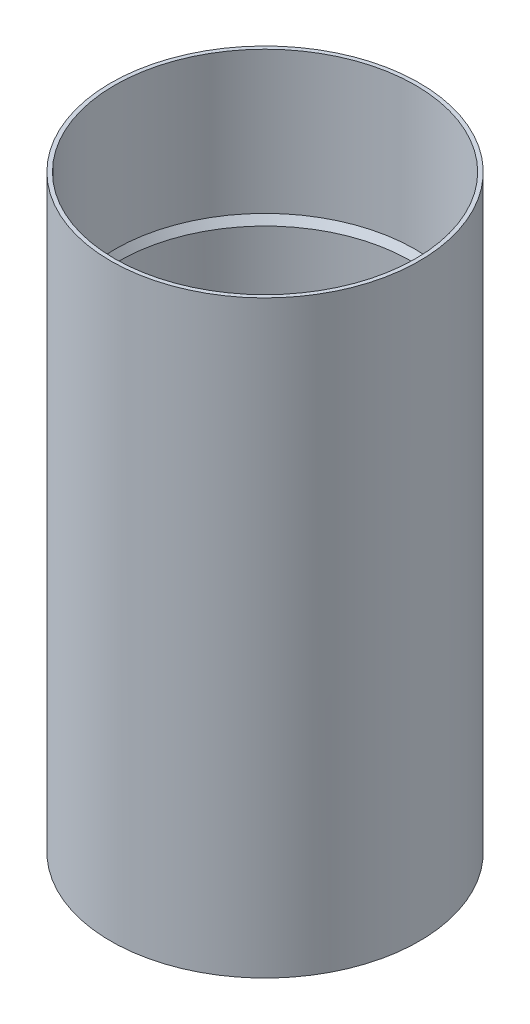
ISO-10303-21;
HEADER;
FILE_DESCRIPTION(('STEP AP214'),'2;1');
FILE_NAME('part.step','',(''),(''),'','','');
FILE_SCHEMA(('AUTOMOTIVE_DESIGN { 1 0 10303 214 1 1 1 1 }'));
ENDSEC;
DATA;
#1=APPLICATION_CONTEXT('core data for automotive mechanical design processes');
#2=APPLICATION_PROTOCOL_DEFINITION('international standard','automotive_design',2000,#1);
#3=PRODUCT_CONTEXT('',#1,'mechanical');
#4=PRODUCT('Part','Part','',(#3));
#5=PRODUCT_RELATED_PRODUCT_CATEGORY('part','',(#4));
#6=PRODUCT_DEFINITION_FORMATION('','',#4);
#7=PRODUCT_DEFINITION_CONTEXT('part definition',#1,'design');
#8=PRODUCT_DEFINITION('design','',#6,#7);
#9=PRODUCT_DEFINITION_SHAPE('','',#8);
#10=(LENGTH_UNIT() NAMED_UNIT(*) SI_UNIT(.MILLI.,.METRE.));
#11=(NAMED_UNIT(*) PLANE_ANGLE_UNIT() SI_UNIT($,.RADIAN.));
#12=(NAMED_UNIT(*) SI_UNIT($,.STERADIAN.) SOLID_ANGLE_UNIT());
#13=UNCERTAINTY_MEASURE_WITH_UNIT(LENGTH_MEASURE(1.E-05),#10,'distance_accuracy_value','');
#14=(GEOMETRIC_REPRESENTATION_CONTEXT(3) GLOBAL_UNCERTAINTY_ASSIGNED_CONTEXT((#13)) GLOBAL_UNIT_ASSIGNED_CONTEXT((#10,
#11,#12)) REPRESENTATION_CONTEXT('',''));
#15=CARTESIAN_POINT('',(0.,0.,0.));
#16=DIRECTION('',(0.,0.,1.));
#17=DIRECTION('',(1.,0.,0.));
#18=AXIS2_PLACEMENT_3D('',#15,#16,#17);
#19=CARTESIAN_POINT('',(0.,105.,0.));
#20=DIRECTION('',(0.,-1.,0.));
#21=DIRECTION('',(0.,0.,-1.));
#22=AXIS2_PLACEMENT_3D('',#19,#20,#21);
#23=CYLINDRICAL_SURFACE('',#22,26.);
#24=CARTESIAN_POINT('',(0.,78.2679491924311,0.));
#25=DIRECTION('',(0.,1.,0.));
#26=DIRECTION('',(0.,0.,1.));
#27=AXIS2_PLACEMENT_3D('',#24,#25,#26);
#28=CIRCLE('',#27,26.);
#29=CARTESIAN_POINT('',(0.,78.2679491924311,26.));
#30=VERTEX_POINT('',#29);
#31=EDGE_CURVE('E42',#30,#30,#28,.T.);
#32=ORIENTED_EDGE('',*,*,#31,.T.);
#33=EDGE_LOOP('',(#32));
#34=FACE_BOUND('',#33,.T.);
#35=CARTESIAN_POINT('',(0.,0.,0.));
#36=DIRECTION('',(0.,1.,0.));
#37=DIRECTION('',(0.,0.,1.));
#38=AXIS2_PLACEMENT_3D('',#35,#36,#37);
#39=CIRCLE('',#38,26.);
#40=CARTESIAN_POINT('',(-8.5,0.,-24.5713247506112));
#41=VERTEX_POINT('',#40);
#42=CARTESIAN_POINT('',(8.5,0.,-24.5713247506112));
#43=VERTEX_POINT('',#42);
#44=EDGE_CURVE('E249',#41,#43,#39,.T.);
#45=ORIENTED_EDGE('',*,*,#44,.F.);
#46=CARTESIAN_POINT('',(-8.5,0.,-24.5713247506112));
#47=CARTESIAN_POINT('',(-8.44182870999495,-3.91145126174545E-05,-24.5914570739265));
#48=CARTESIAN_POINT('',(-8.38356460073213,0.00507484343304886,-24.6113723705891));
#49=CARTESIAN_POINT('',(-8.26844314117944,0.0254324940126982,-24.6502824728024));
#50=CARTESIAN_POINT('',(-8.21158749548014,0.0406878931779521,-24.6692761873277));
#51=CARTESIAN_POINT('',(-8.10094424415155,0.0811780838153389,-24.7058319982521));
#52=CARTESIAN_POINT('',(-8.04716080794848,0.106426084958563,-24.7233921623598));
#53=CARTESIAN_POINT('',(-7.94451263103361,0.166357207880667,-24.7565672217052));
#54=CARTESIAN_POINT('',(-7.89564399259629,0.20103277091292,-24.772183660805));
#55=CARTESIAN_POINT('',(-7.8059967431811,0.277695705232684,-24.8005757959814));
#56=CARTESIAN_POINT('',(-7.76500488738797,0.319405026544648,-24.8134280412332));
#57=CARTESIAN_POINT('',(-7.69063870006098,0.409782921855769,-24.8365778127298));
#58=CARTESIAN_POINT('',(-7.65726506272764,0.458452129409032,-24.8468751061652));
#59=CARTESIAN_POINT('',(-7.60082495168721,0.558818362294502,-24.8641970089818));
#60=CARTESIAN_POINT('',(-7.57734071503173,0.610258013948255,-24.8713549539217));
#61=CARTESIAN_POINT('',(-7.53933933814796,0.716610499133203,-24.8829009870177));
#62=CARTESIAN_POINT('',(-7.52481093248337,0.77151887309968,-24.8872925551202));
#63=CARTESIAN_POINT('',(-7.51002940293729,0.855780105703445,-24.8917553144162));
#64=CARTESIAN_POINT('',(-7.50626972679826,0.884505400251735,-24.892889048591));
#65=CARTESIAN_POINT('',(-7.5012566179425,0.942148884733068,-24.8944000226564));
#66=CARTESIAN_POINT('',(-7.49999932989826,0.971066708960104,-24.8947784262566));
#67=CARTESIAN_POINT('',(-7.5,1.,-24.8947785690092));
#68=B_SPLINE_CURVE_WITH_KNOTS('',3,(#46,#47,#48,#49,#50,#51,#52,#53,#54,#55,#56,#57,#58,#59,#60,
#61,#62,#63,#64,#65,#66,#67),.UNSPECIFIED.,.F.,.F.,(4,2,2,2,2,2,2,2,2,2,4),(0.,0.18448524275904,
0.369183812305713,0.554127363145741,0.738923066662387,0.917639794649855,1.09637280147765,
1.2665288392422,1.43647040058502,1.52334396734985,1.61008358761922),.UNSPECIFIED.);
#69=CARTESIAN_POINT('',(-7.50000000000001,1.,-24.8947785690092));
#70=VERTEX_POINT('',#69);
#71=EDGE_CURVE('E160',#41,#70,#68,.T.);
#72=ORIENTED_EDGE('',*,*,#71,.T.);
#73=DIRECTION('',(0.,-1.,0.));
#74=VECTOR('',#73,1.);
#75=CARTESIAN_POINT('',(-7.50000000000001,105.,-24.8947785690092));
#76=LINE('',#75,#74);
#77=CARTESIAN_POINT('',(-7.50000000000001,13.5,-24.8947785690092));
#78=VERTEX_POINT('',#77);
#79=EDGE_CURVE('E125',#78,#70,#76,.T.);
#80=ORIENTED_EDGE('',*,*,#79,.F.);
#81=CARTESIAN_POINT('',(-7.5,13.5,-24.8947785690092));
#82=CARTESIAN_POINT('',(-7.50000043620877,13.5273039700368,-24.8947781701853));
#83=CARTESIAN_POINT('',(-7.49888099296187,13.5545945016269,-24.8951157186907));
#84=CARTESIAN_POINT('',(-7.49441922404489,13.6089727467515,-24.8964593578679));
#85=CARTESIAN_POINT('',(-7.4910772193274,13.6360604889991,-24.8974653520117));
#86=CARTESIAN_POINT('',(-7.47776791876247,13.7166117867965,-24.9014673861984));
#87=CARTESIAN_POINT('',(-7.46451710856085,13.7695234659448,-24.9054475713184));
#88=CARTESIAN_POINT('',(-7.42971758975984,13.8722513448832,-24.9158508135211));
#89=CARTESIAN_POINT('',(-7.4081687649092,13.9220675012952,-24.9222739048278));
#90=CARTESIAN_POINT('',(-7.35748435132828,14.0173307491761,-24.9372837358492));
#91=CARTESIAN_POINT('',(-7.32834728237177,14.0627769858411,-24.945870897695));
#92=CARTESIAN_POINT('',(-7.26274946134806,14.1490036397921,-24.9650487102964));
#93=CARTESIAN_POINT('',(-7.22615652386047,14.189675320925,-24.9756752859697));
#94=CARTESIAN_POINT('',(-7.14709284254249,14.2643488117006,-24.998415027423));
#95=CARTESIAN_POINT('',(-7.10462047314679,14.298348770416,-25.010528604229));
#96=CARTESIAN_POINT('',(-7.01319243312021,14.3601140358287,-25.0363230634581));
#97=CARTESIAN_POINT('',(-6.96404710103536,14.3875804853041,-25.0500469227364));
#98=CARTESIAN_POINT('',(-6.86202344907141,14.4338495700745,-25.0781863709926));
#99=CARTESIAN_POINT('',(-6.80914575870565,14.4526536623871,-25.0926018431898));
#100=CARTESIAN_POINT('',(-6.71351197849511,14.4778884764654,-25.1183321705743));
#101=CARTESIAN_POINT('',(-6.67122045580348,14.4861691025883,-25.12959875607));
#102=CARTESIAN_POINT('',(-6.5859671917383,14.4972255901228,-25.1520775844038));
#103=CARTESIAN_POINT('',(-6.5430063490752,14.5000082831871,-25.1632898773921));
#104=CARTESIAN_POINT('',(-6.5,14.5,-25.1743917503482));
#105=B_SPLINE_CURVE_WITH_KNOTS('',3,(#81,#82,#83,#84,#85,#86,#87,#88,#89,#90,#91,#92,#93,#94,
#95,#96,#97,#98,#99,#100,#101,#102,#103,#104),.UNSPECIFIED.,.F.,.F.,(4,2,2,2,2,2,2,2,2,2,2,4),
(0.,0.0818603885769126,0.163708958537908,0.326932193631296,0.490157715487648,0.653415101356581,
0.819867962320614,0.986366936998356,1.1594340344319,1.33247201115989,1.4657685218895,
1.5988992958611),.UNSPECIFIED.);
#106=CARTESIAN_POINT('',(-6.5,14.5,-25.1743917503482));
#107=VERTEX_POINT('',#106);
#108=EDGE_CURVE('E204',#78,#107,#105,.T.);
#109=ORIENTED_EDGE('',*,*,#108,.T.);
#110=CARTESIAN_POINT('',(0.,14.5,0.));
#111=DIRECTION('',(0.,1.,0.));
#112=DIRECTION('',(0.,0.,1.));
#113=AXIS2_PLACEMENT_3D('',#110,#111,#112);
#114=CIRCLE('',#113,26.);
#115=CARTESIAN_POINT('',(6.5,14.5,-25.1743917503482));
#116=VERTEX_POINT('',#115);
#117=EDGE_CURVE('E123',#116,#107,#114,.T.);
#118=ORIENTED_EDGE('',*,*,#117,.F.);
#119=CARTESIAN_POINT('',(6.5,14.5,-25.1743917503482));
#120=CARTESIAN_POINT('',(6.55798855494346,14.5000388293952,-25.1594273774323));
#121=CARTESIAN_POINT('',(6.61590978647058,14.4949584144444,-25.1442504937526));
#122=CARTESIAN_POINT('',(6.73002523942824,14.4748966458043,-25.1139430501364));
#123=CARTESIAN_POINT('',(6.78621947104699,14.4599153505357,-25.0988124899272));
#124=CARTESIAN_POINT('',(6.89532098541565,14.4203778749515,-25.0690602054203));
#125=CARTESIAN_POINT('',(6.94822633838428,14.3958161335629,-25.0544387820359));
#126=CARTESIAN_POINT('',(7.04916086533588,14.3377405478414,-25.0262276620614));
#127=CARTESIAN_POINT('',(7.09719164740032,14.3042296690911,-25.0126376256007));
#128=CARTESIAN_POINT('',(7.18640708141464,14.2295156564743,-24.9871504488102));
#129=CARTESIAN_POINT('',(7.22766256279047,14.1884031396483,-24.9752360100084));
#130=CARTESIAN_POINT('',(7.30263085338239,14.0993088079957,-24.9534188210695));
#131=CARTESIAN_POINT('',(7.33634314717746,14.0513265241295,-24.9435162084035));
#132=CARTESIAN_POINT('',(7.39399061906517,13.9516435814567,-24.9264874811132));
#133=CARTESIAN_POINT('',(7.41822497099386,13.9001301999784,-24.9192768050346));
#134=CARTESIAN_POINT('',(7.45764413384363,13.7934944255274,-24.9075083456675));
#135=CARTESIAN_POINT('',(7.47283985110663,13.7383764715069,-24.9029473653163));
#136=CARTESIAN_POINT('',(7.48880964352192,13.6522935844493,-24.8981477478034));
#137=CARTESIAN_POINT('',(7.49300368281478,13.6219799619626,-24.8968855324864));
#138=CARTESIAN_POINT('',(7.49859763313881,13.5611161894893,-24.8952010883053));
#139=CARTESIAN_POINT('',(7.50000148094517,13.5305664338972,-24.8947776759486));
#140=CARTESIAN_POINT('',(7.5,13.5,-24.8947785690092));
#141=B_SPLINE_CURVE_WITH_KNOTS('',3,(#119,#120,#121,#122,#123,#124,#125,#126,#127,#128,#129,
#130,#131,#132,#133,#134,#135,#136,#137,#138,#139,#140),.UNSPECIFIED.,.F.,.F.,(4,2,2,2,2,2,2,2,
2,2,4),(0.,0.179434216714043,0.358867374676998,0.538404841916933,0.717882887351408,
0.895345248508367,1.07281973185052,1.24412390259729,1.41522095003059,1.50698200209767,
1.59861349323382),.UNSPECIFIED.);
#142=CARTESIAN_POINT('',(7.5,13.5,-24.8947785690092));
#143=VERTEX_POINT('',#142);
#144=EDGE_CURVE('E122',#116,#143,#141,.T.);
#145=ORIENTED_EDGE('',*,*,#144,.T.);
#146=DIRECTION('',(0.,-1.,0.));
#147=VECTOR('',#146,1.);
#148=CARTESIAN_POINT('',(7.5,105.,-24.8947785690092));
#149=LINE('',#148,#147);
#150=CARTESIAN_POINT('',(7.5,1.,-24.8947785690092));
#151=VERTEX_POINT('',#150);
#152=EDGE_CURVE('E117',#151,#143,#149,.F.);
#153=ORIENTED_EDGE('',*,*,#152,.F.);
#154=CARTESIAN_POINT('',(7.5,1.,-24.8947785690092));
#155=CARTESIAN_POINT('',(7.49999958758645,0.972765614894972,-24.8947784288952));
#156=CARTESIAN_POINT('',(7.50111331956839,0.9455445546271,-24.8944431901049));
#157=CARTESIAN_POINT('',(7.5055524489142,0.891303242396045,-24.8931052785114));
#158=CARTESIAN_POINT('',(7.50887757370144,0.864282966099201,-24.8921026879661));
#159=CARTESIAN_POINT('',(7.52212148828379,0.783920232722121,-24.8881051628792));
#160=CARTESIAN_POINT('',(7.53530902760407,0.731126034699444,-24.8841204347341));
#161=CARTESIAN_POINT('',(7.56994223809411,0.628618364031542,-24.8736064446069));
#162=CARTESIAN_POINT('',(7.59138885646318,0.57890524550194,-24.8670768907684));
#163=CARTESIAN_POINT('',(7.64181071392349,0.483856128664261,-24.8516281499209));
#164=CARTESIAN_POINT('',(7.6707868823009,0.438520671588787,-24.8427086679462));
#165=CARTESIAN_POINT('',(7.73586050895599,0.352666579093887,-24.8225227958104));
#166=CARTESIAN_POINT('',(7.77206740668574,0.31223958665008,-24.8112201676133));
#167=CARTESIAN_POINT('',(7.85015893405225,0.238022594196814,-24.7866229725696));
#168=CARTESIAN_POINT('',(7.89204472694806,0.204233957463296,-24.7733279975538));
#169=CARTESIAN_POINT('',(7.98206895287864,0.142773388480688,-24.7444720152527));
#170=CARTESIAN_POINT('',(8.0303921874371,0.115405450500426,-24.7288409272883));
#171=CARTESIAN_POINT('',(8.13048309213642,0.0691415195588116,-24.6961133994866));
#172=CARTESIAN_POINT('',(8.18225141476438,0.0502471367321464,-24.6790166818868));
#173=CARTESIAN_POINT('',(8.27834720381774,0.0238395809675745,-24.6469277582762));
#174=CARTESIAN_POINT('',(8.32234602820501,0.0148937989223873,-24.6321073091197));
#175=CARTESIAN_POINT('',(8.41091016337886,0.00297408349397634,-24.6020082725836));
#176=CARTESIAN_POINT('',(8.45547442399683,-9.6429937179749E-06,-24.5867304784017));
#177=CARTESIAN_POINT('',(8.5,0.,-24.5713247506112));
#178=B_SPLINE_CURVE_WITH_KNOTS('',3,(#154,#155,#156,#157,#158,#159,#160,#161,#162,#163,#164,
#165,#166,#167,#168,#169,#170,#171,#172,#173,#174,#175,#176,#177),.UNSPECIFIED.,.F.,.F.,(4,2,2,
2,2,2,2,2,2,2,2,4),(0.,0.0816520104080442,0.163293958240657,0.326134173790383,0.488993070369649,
0.65187207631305,0.817434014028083,0.983029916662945,1.15534826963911,1.32769935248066,
1.46917092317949,1.61040992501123),.UNSPECIFIED.);
#179=EDGE_CURVE('E102',#151,#43,#178,.T.);
#180=ORIENTED_EDGE('',*,*,#179,.T.);
#181=EDGE_LOOP('',(#45,#72,#80,#109,#118,#145,#153,#180));
#182=FACE_BOUND('',#181,.T.);
#183=ADVANCED_FACE('F34',(#34,#182),#23,.F.);
#184=CARTESIAN_POINT('',(0.,105.,0.));
#185=DIRECTION('',(0.,1.,0.));
#186=DIRECTION('',(0.,0.,1.));
#187=AXIS2_PLACEMENT_3D('',#184,#185,#186);
#188=PLANE('',#187);
#189=CARTESIAN_POINT('',(0.,105.,0.));
#190=DIRECTION('',(0.,1.,0.));
#191=DIRECTION('',(0.,0.,1.));
#192=AXIS2_PLACEMENT_3D('',#189,#190,#191);
#193=CIRCLE('',#192,26.8);
#194=CARTESIAN_POINT('',(0.,105.,26.8));
#195=VERTEX_POINT('',#194);
#196=EDGE_CURVE('E241',#195,#195,#193,.T.);
#197=ORIENTED_EDGE('',*,*,#196,.F.);
#198=EDGE_LOOP('',(#197));
#199=FACE_BOUND('',#198,.T.);
#200=CARTESIAN_POINT('',(0.,105.,0.));
#201=DIRECTION('',(0.,1.,0.));
#202=DIRECTION('',(0.,0.,1.));
#203=AXIS2_PLACEMENT_3D('',#200,#201,#202);
#204=CIRCLE('',#203,27.5);
#205=CARTESIAN_POINT('',(0.,105.,27.5));
#206=VERTEX_POINT('',#205);
#207=EDGE_CURVE('E244',#206,#206,#204,.T.);
#208=ORIENTED_EDGE('',*,*,#207,.T.);
#209=EDGE_LOOP('',(#208));
#210=FACE_BOUND('',#209,.T.);
#211=ADVANCED_FACE('F228',(#199,#210),#188,.T.);
#212=CARTESIAN_POINT('',(0.,0.,0.));
#213=DIRECTION('',(0.,1.,0.));
#214=DIRECTION('',(0.,0.,1.));
#215=AXIS2_PLACEMENT_3D('',#212,#213,#214);
#216=PLANE('',#215);
#217=CARTESIAN_POINT('',(0.,0.,0.));
#218=DIRECTION('',(0.,1.,0.));
#219=DIRECTION('',(0.,0.,1.));
#220=AXIS2_PLACEMENT_3D('',#217,#218,#219);
#221=CIRCLE('',#220,27.5);
#222=CARTESIAN_POINT('',(-8.5,0.,-26.153393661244));
#223=VERTEX_POINT('',#222);
#224=CARTESIAN_POINT('',(8.5,0.,-26.153393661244));
#225=VERTEX_POINT('',#224);
#226=EDGE_CURVE('E246',#223,#225,#221,.T.);
#227=ORIENTED_EDGE('',*,*,#226,.F.);
#228=DIRECTION('',(0.,0.,1.));
#229=VECTOR('',#228,1.);
#230=CARTESIAN_POINT('',(-8.5,0.,0.));
#231=LINE('',#230,#229);
#232=EDGE_CURVE('E157',#223,#41,#231,.T.);
#233=ORIENTED_EDGE('',*,*,#232,.T.);
#234=ORIENTED_EDGE('',*,*,#44,.T.);
#235=DIRECTION('',(0.,0.,1.));
#236=VECTOR('',#235,1.);
#237=CARTESIAN_POINT('',(8.5,0.,0.));
#238=LINE('',#237,#236);
#239=EDGE_CURVE('E108',#43,#225,#238,.F.);
#240=ORIENTED_EDGE('',*,*,#239,.T.);
#241=EDGE_LOOP('',(#227,#233,#234,#240));
#242=FACE_BOUND('',#241,.T.);
#243=ADVANCED_FACE('F232',(#242),#216,.F.);
#244=CARTESIAN_POINT('',(0.,105.,0.));
#245=DIRECTION('',(0.,-1.,0.));
#246=DIRECTION('',(0.,0.,-1.));
#247=AXIS2_PLACEMENT_3D('',#244,#245,#246);
#248=CYLINDRICAL_SURFACE('',#247,27.5);
#249=ORIENTED_EDGE('',*,*,#207,.F.);
#250=EDGE_LOOP('',(#249));
#251=FACE_BOUND('',#250,.T.);
#252=DIRECTION('',(0.,-1.,0.));
#253=VECTOR('',#252,1.);
#254=CARTESIAN_POINT('',(-7.50000000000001,105.,-26.4575131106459));
#255=LINE('',#254,#253);
#256=CARTESIAN_POINT('',(-7.50000000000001,13.5,-26.4575131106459));
#257=VERTEX_POINT('',#256);
#258=CARTESIAN_POINT('',(-7.50000000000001,1.,-26.4575131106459));
#259=VERTEX_POINT('',#258);
#260=EDGE_CURVE('E256',#257,#259,#255,.T.);
#261=ORIENTED_EDGE('',*,*,#260,.T.);
#262=CARTESIAN_POINT('',(-7.5,1.,-26.4575131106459));
#263=CARTESIAN_POINT('',(-7.49999964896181,0.972668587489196,-26.4575129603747));
#264=CARTESIAN_POINT('',(-7.5011212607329,0.945350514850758,-26.4571952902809));
#265=CARTESIAN_POINT('',(-7.50559223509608,0.890915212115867,-26.4559273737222));
#266=CARTESIAN_POINT('',(-7.50894134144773,0.863797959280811,-26.4549772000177));
#267=CARTESIAN_POINT('',(-7.52228282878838,0.783139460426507,-26.4511880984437));
#268=CARTESIAN_POINT('',(-7.53556957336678,0.730147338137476,-26.4474105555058));
#269=CARTESIAN_POINT('',(-7.5704761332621,0.627250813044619,-26.4374396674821));
#270=CARTESIAN_POINT('',(-7.5920972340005,0.577346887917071,-26.4312459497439));
#271=CARTESIAN_POINT('',(-7.64294965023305,0.481940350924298,-26.4165860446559));
#272=CARTESIAN_POINT('',(-7.67218165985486,0.436438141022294,-26.4081196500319));
#273=CARTESIAN_POINT('',(-7.73780200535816,0.350364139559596,-26.3889674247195));
#274=CARTESIAN_POINT('',(-7.77428964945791,0.309875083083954,-26.3782506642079));
#275=CARTESIAN_POINT('',(-7.85301121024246,0.235581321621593,-26.3549217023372));
#276=CARTESIAN_POINT('',(-7.89524631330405,0.201778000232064,-26.3423091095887));
#277=CARTESIAN_POINT('',(-7.98585201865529,0.140493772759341,-26.3149859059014));
#278=CARTESIAN_POINT('',(-8.03438956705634,0.113286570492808,-26.30021580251));
#279=CARTESIAN_POINT('',(-8.1349292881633,0.0673814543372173,-26.2692917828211));
#280=CARTESIAN_POINT('',(-8.18693183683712,0.0486844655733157,-26.2531377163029));
#281=CARTESIAN_POINT('',(-8.2824758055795,0.022951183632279,-26.2231305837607));
#282=CARTESIAN_POINT('',(-8.32565750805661,0.0143403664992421,-26.2094539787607));
#283=CARTESIAN_POINT('',(-8.41257014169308,0.0028648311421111,-26.1816877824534));
#284=CARTESIAN_POINT('',(-8.45630007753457,-9.10873909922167E-06,-26.1675988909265));
#285=CARTESIAN_POINT('',(-8.5,0.,-26.153393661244));
#286=B_SPLINE_CURVE_WITH_KNOTS('',3,(#262,#263,#264,#265,#266,#267,#268,#269,#270,#271,#272,
#273,#274,#275,#276,#277,#278,#279,#280,#281,#282,#283,#284,#285),.UNSPECIFIED.,.F.,.F.,(4,2,2,
2,2,2,2,2,2,2,2,4),(0.,0.0819430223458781,0.163876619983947,0.327317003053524,0.490782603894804,
0.654263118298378,0.820157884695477,0.986086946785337,1.15803276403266,1.32999726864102,
1.46796512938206,1.60571103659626),.UNSPECIFIED.);
#287=EDGE_CURVE('E171',#259,#223,#286,.T.);
#288=ORIENTED_EDGE('',*,*,#287,.T.);
#289=ORIENTED_EDGE('',*,*,#226,.T.);
#290=CARTESIAN_POINT('',(8.5,0.,-26.153393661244));
#291=CARTESIAN_POINT('',(8.44205385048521,-4.01872291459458E-05,-26.172234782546));
#292=CARTESIAN_POINT('',(8.3840279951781,0.00503538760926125,-26.1908724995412));
#293=CARTESIAN_POINT('',(8.26941063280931,0.0252196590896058,-26.2272825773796));
#294=CARTESIAN_POINT('',(8.21282049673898,0.040337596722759,-26.2450541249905));
#295=CARTESIAN_POINT('',(8.10271370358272,0.0804320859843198,-26.2792578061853));
#296=CARTESIAN_POINT('',(8.04920090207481,0.105420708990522,-26.295688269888));
#297=CARTESIAN_POINT('',(7.94705528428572,0.164695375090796,-26.3267383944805));
#298=CARTESIAN_POINT('',(7.89841897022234,0.198974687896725,-26.3413593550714));
#299=CARTESIAN_POINT('',(7.80896374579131,0.274872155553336,-26.3680148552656));
#300=CARTESIAN_POINT('',(7.76795970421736,0.316249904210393,-26.3801118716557));
#301=CARTESIAN_POINT('',(7.69350669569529,0.405894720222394,-26.4019215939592));
#302=CARTESIAN_POINT('',(7.66005853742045,0.454162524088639,-26.4116340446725));
#303=CARTESIAN_POINT('',(7.60321726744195,0.553973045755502,-26.4280519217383));
#304=CARTESIAN_POINT('',(7.57945658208,0.605288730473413,-26.4348678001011));
#305=CARTESIAN_POINT('',(7.54088769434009,0.711414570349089,-26.4458960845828));
#306=CARTESIAN_POINT('',(7.52606894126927,0.766220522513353,-26.4501115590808));
#307=CARTESIAN_POINT('',(7.51066983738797,0.851270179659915,-26.4544866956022));
#308=CARTESIAN_POINT('',(7.50667023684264,0.880885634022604,-26.4556215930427));
#309=CARTESIAN_POINT('',(7.50133683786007,0.940329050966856,-26.457134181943));
#310=CARTESIAN_POINT('',(7.49999897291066,0.970156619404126,-26.4575130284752));
#311=CARTESIAN_POINT('',(7.5,1.,-26.4575131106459));
#312=B_SPLINE_CURVE_WITH_KNOTS('',3,(#290,#291,#292,#293,#294,#295,#296,#297,#298,#299,#300,
#301,#302,#303,#304,#305,#306,#307,#308,#309,#310,#311),.UNSPECIFIED.,.F.,.F.,(4,2,2,2,2,2,2,2,
2,2,4),(0.,0.182607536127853,0.365383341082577,0.548383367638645,0.731251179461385,
0.908840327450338,1.08644847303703,1.25649226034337,1.42633501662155,1.51593866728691,
1.60540531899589),.UNSPECIFIED.);
#313=CARTESIAN_POINT('',(7.5,1.,-26.4575131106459));
#314=VERTEX_POINT('',#313);
#315=EDGE_CURVE('E151',#225,#314,#312,.T.);
#316=ORIENTED_EDGE('',*,*,#315,.T.);
#317=DIRECTION('',(0.,-1.,0.));
#318=VECTOR('',#317,1.);
#319=CARTESIAN_POINT('',(7.5,105.,-26.4575131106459));
#320=LINE('',#319,#318);
#321=CARTESIAN_POINT('',(7.5,13.5,-26.4575131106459));
#322=VERTEX_POINT('',#321);
#323=EDGE_CURVE('E119',#314,#322,#320,.F.);
#324=ORIENTED_EDGE('',*,*,#323,.T.);
#325=CARTESIAN_POINT('',(7.5,13.5,-26.4575131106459));
#326=CARTESIAN_POINT('',(7.50000037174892,13.5273934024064,-26.4575127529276));
#327=CARTESIAN_POINT('',(7.49887365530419,13.5547733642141,-26.4578324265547));
#328=CARTESIAN_POINT('',(7.49438244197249,13.609330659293,-26.4591050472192));
#329=CARTESIAN_POINT('',(7.49101824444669,13.6365080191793,-26.4600579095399));
#330=CARTESIAN_POINT('',(7.47761829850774,13.717334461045,-26.4638492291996));
#331=CARTESIAN_POINT('',(7.46427498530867,13.7704312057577,-26.4676205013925));
#332=CARTESIAN_POINT('',(7.42921963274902,13.8735238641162,-26.4774814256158));
#333=CARTESIAN_POINT('',(7.40750705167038,13.9235195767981,-26.4835712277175));
#334=CARTESIAN_POINT('',(7.35641933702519,14.0191169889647,-26.4978073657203));
#335=CARTESIAN_POINT('',(7.32704300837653,14.0647180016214,-26.5059540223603));
#336=CARTESIAN_POINT('',(7.26095231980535,14.1511239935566,-26.5241354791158));
#337=CARTESIAN_POINT('',(7.22411840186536,14.191830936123,-26.5342008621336));
#338=CARTESIAN_POINT('',(7.14452395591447,14.2665305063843,-26.5557427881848));
#339=CARTESIAN_POINT('',(7.10176182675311,14.300521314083,-26.5672197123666));
#340=CARTESIAN_POINT('',(7.00990007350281,14.3620704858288,-26.5916083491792));
#341=CARTESIAN_POINT('',(6.96063047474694,14.3893606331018,-26.6045563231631));
#342=CARTESIAN_POINT('',(6.85836961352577,14.435259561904,-26.6311012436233));
#343=CARTESIAN_POINT('',(6.80537914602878,14.4538701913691,-26.6446980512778));
#344=CARTESIAN_POINT('',(6.71024825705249,14.4785663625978,-26.6687899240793));
#345=CARTESIAN_POINT('',(6.66858855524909,14.4865937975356,-26.6792385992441));
#346=CARTESIAN_POINT('',(6.58463249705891,14.4973112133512,-26.7000844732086));
#347=CARTESIAN_POINT('',(6.54233700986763,14.5000079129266,-26.7104817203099));
#348=CARTESIAN_POINT('',(6.5,14.5,-26.7207784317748));
#349=B_SPLINE_CURVE_WITH_KNOTS('',3,(#325,#326,#327,#328,#329,#330,#331,#332,#333,#334,#335,
#336,#337,#338,#339,#340,#341,#342,#343,#344,#345,#346,#347,#348),.UNSPECIFIED.,.F.,.F.,(4,2,2,
2,2,2,2,2,2,2,2,4),(0.,0.0821286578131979,0.164246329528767,0.32802774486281,0.49181976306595,
0.655637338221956,0.822325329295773,0.989058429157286,1.16165446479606,1.33421373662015,
1.4649775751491,1.59557649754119),.UNSPECIFIED.);
#350=CARTESIAN_POINT('',(6.5,14.5,-26.7207784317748));
#351=VERTEX_POINT('',#350);
#352=EDGE_CURVE('E56',#322,#351,#349,.T.);
#353=ORIENTED_EDGE('',*,*,#352,.T.);
#354=CARTESIAN_POINT('',(0.,14.5,0.));
#355=DIRECTION('',(0.,1.,0.));
#356=DIRECTION('',(0.,0.,1.));
#357=AXIS2_PLACEMENT_3D('',#354,#355,#356);
#358=CIRCLE('',#357,27.5);
#359=CARTESIAN_POINT('',(-6.5,14.5,-26.7207784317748));
#360=VERTEX_POINT('',#359);
#361=EDGE_CURVE('E253',#351,#360,#358,.T.);
#362=ORIENTED_EDGE('',*,*,#361,.T.);
#363=CARTESIAN_POINT('',(-6.5,14.5,-26.7207784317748));
#364=CARTESIAN_POINT('',(-6.5577925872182,14.500039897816,-26.7067276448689));
#365=CARTESIAN_POINT('',(-6.61552417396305,14.4949924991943,-26.6924780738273));
#366=CARTESIAN_POINT('',(-6.72927148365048,14.4750623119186,-26.6640250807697));
#367=CARTESIAN_POINT('',(-6.78528736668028,14.4601804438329,-26.6498216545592));
#368=CARTESIAN_POINT('',(-6.8940518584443,14.4209091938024,-26.6218939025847));
#369=CARTESIAN_POINT('',(-6.94679858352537,14.3965143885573,-26.6081698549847));
#370=CARTESIAN_POINT('',(-7.04744600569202,14.3388465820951,-26.5816893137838));
#371=CARTESIAN_POINT('',(-7.0953482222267,14.3055763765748,-26.568932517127));
#372=CARTESIAN_POINT('',(-7.18441359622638,14.2313719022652,-26.5449865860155));
#373=CARTESIAN_POINT('',(-7.22563890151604,14.1905169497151,-26.533783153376));
#374=CARTESIAN_POINT('',(-7.30059885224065,14.1019993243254,-26.5132565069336));
#375=CARTESIAN_POINT('',(-7.33433285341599,14.0543360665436,-26.5039334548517));
#376=CARTESIAN_POINT('',(-7.39221802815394,13.9551316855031,-26.4878460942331));
#377=CARTESIAN_POINT('',(-7.41663261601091,13.9037554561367,-26.4810117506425));
#378=CARTESIAN_POINT('',(-7.45643775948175,13.7973917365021,-26.4698312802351));
#379=CARTESIAN_POINT('',(-7.4718385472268,13.7424084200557,-26.4654823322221));
#380=CARTESIAN_POINT('',(-7.48828882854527,13.6557775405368,-26.4608307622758));
#381=CARTESIAN_POINT('',(-7.4926779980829,13.6247767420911,-26.4595878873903));
#382=CARTESIAN_POINT('',(-7.49853242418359,13.5625226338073,-26.4579291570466));
#383=CARTESIAN_POINT('',(-7.5000017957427,13.5312697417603,-26.4575121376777));
#384=CARTESIAN_POINT('',(-7.5,13.5,-26.4575131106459));
#385=B_SPLINE_CURVE_WITH_KNOTS('',3,(#363,#364,#365,#366,#367,#368,#369,#370,#371,#372,#373,
#374,#375,#376,#377,#378,#379,#380,#381,#382,#383,#384),.UNSPECIFIED.,.F.,.F.,(4,2,2,2,2,2,2,2,
2,2,4),(0.,0.178198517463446,0.356380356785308,0.534663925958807,0.712891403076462,
0.889350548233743,1.06582486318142,1.23685754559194,1.40769569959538,1.50156706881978,
1.59530604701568),.UNSPECIFIED.);
#386=EDGE_CURVE('E210',#360,#257,#385,.T.);
#387=ORIENTED_EDGE('',*,*,#386,.T.);
#388=EDGE_LOOP('',(#261,#288,#289,#316,#324,#353,#362,#387));
#389=FACE_BOUND('',#388,.T.);
#390=ADVANCED_FACE('F145',(#251,#389),#248,.T.);
#391=CARTESIAN_POINT('',(7.5,14.5,-100.));
#392=DIRECTION('',(0.,1.,0.));
#393=DIRECTION('',(0.,0.,1.));
#394=AXIS2_PLACEMENT_3D('',#391,#392,#393);
#395=PLANE('',#394);
#396=ORIENTED_EDGE('',*,*,#361,.F.);
#397=DIRECTION('',(0.,0.,1.));
#398=VECTOR('',#397,1.);
#399=CARTESIAN_POINT('',(6.5,14.5,-24.8947785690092));
#400=LINE('',#399,#398);
#401=EDGE_CURVE('E178',#351,#116,#400,.T.);
#402=ORIENTED_EDGE('',*,*,#401,.T.);
#403=ORIENTED_EDGE('',*,*,#117,.T.);
#404=DIRECTION('',(0.,0.,1.));
#405=VECTOR('',#404,1.);
#406=CARTESIAN_POINT('',(-6.5,14.5,-26.4575131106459));
#407=LINE('',#406,#405);
#408=EDGE_CURVE('E49',#107,#360,#407,.F.);
#409=ORIENTED_EDGE('',*,*,#408,.T.);
#410=EDGE_LOOP('',(#396,#402,#403,#409));
#411=FACE_BOUND('',#410,.T.);
#412=ADVANCED_FACE('F270',(#411),#395,.F.);
#413=CARTESIAN_POINT('',(7.5,0.,-100.));
#414=DIRECTION('',(1.,0.,0.));
#415=DIRECTION('',(0.,0.,-1.));
#416=AXIS2_PLACEMENT_3D('',#413,#414,#415);
#417=PLANE('',#416);
#418=ORIENTED_EDGE('',*,*,#152,.T.);
#419=DIRECTION('',(0.,0.,1.));
#420=VECTOR('',#419,1.);
#421=CARTESIAN_POINT('',(7.5,13.5,-26.4575131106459));
#422=LINE('',#421,#420);
#423=EDGE_CURVE('E181',#143,#322,#422,.F.);
#424=ORIENTED_EDGE('',*,*,#423,.T.);
#425=ORIENTED_EDGE('',*,*,#323,.F.);
#426=DIRECTION('',(0.,0.,1.));
#427=VECTOR('',#426,1.);
#428=CARTESIAN_POINT('',(7.5,1.,-100.));
#429=LINE('',#428,#427);
#430=EDGE_CURVE('E106',#314,#151,#429,.T.);
#431=ORIENTED_EDGE('',*,*,#430,.T.);
#432=EDGE_LOOP('',(#418,#424,#425,#431));
#433=FACE_BOUND('',#432,.T.);
#434=ADVANCED_FACE('F116',(#433),#417,.F.);
#435=CARTESIAN_POINT('',(-7.5,14.5,-100.));
#436=DIRECTION('',(-1.,0.,0.));
#437=DIRECTION('',(0.,-1.,0.));
#438=AXIS2_PLACEMENT_3D('',#435,#436,#437);
#439=PLANE('',#438);
#440=ORIENTED_EDGE('',*,*,#79,.T.);
#441=DIRECTION('',(0.,0.,1.));
#442=VECTOR('',#441,1.);
#443=CARTESIAN_POINT('',(-7.5,1.,-100.));
#444=LINE('',#443,#442);
#445=EDGE_CURVE('E169',#70,#259,#444,.F.);
#446=ORIENTED_EDGE('',*,*,#445,.T.);
#447=ORIENTED_EDGE('',*,*,#260,.F.);
#448=DIRECTION('',(0.,0.,1.));
#449=VECTOR('',#448,1.);
#450=CARTESIAN_POINT('',(-7.5,13.5,-24.8947785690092));
#451=LINE('',#450,#449);
#452=EDGE_CURVE('E166',#257,#78,#451,.T.);
#453=ORIENTED_EDGE('',*,*,#452,.T.);
#454=EDGE_LOOP('',(#440,#446,#447,#453));
#455=FACE_BOUND('',#454,.T.);
#456=ADVANCED_FACE('F144',(#455),#439,.F.);
#457=CARTESIAN_POINT('',(8.5,1.,-100.));
#458=DIRECTION('',(0.,0.,1.));
#459=DIRECTION('',(1.,0.,0.));
#460=AXIS2_PLACEMENT_3D('',#457,#458,#459);
#461=CYLINDRICAL_SURFACE('',#460,1.);
#462=ORIENTED_EDGE('',*,*,#315,.F.);
#463=ORIENTED_EDGE('',*,*,#239,.F.);
#464=ORIENTED_EDGE('',*,*,#179,.F.);
#465=ORIENTED_EDGE('',*,*,#430,.F.);
#466=EDGE_LOOP('',(#462,#463,#464,#465));
#467=FACE_BOUND('',#466,.T.);
#468=ADVANCED_FACE('F105',(#467),#461,.T.);
#469=CARTESIAN_POINT('',(-8.5,1.,0.));
#470=DIRECTION('',(0.,0.,1.));
#471=DIRECTION('',(1.,0.,0.));
#472=AXIS2_PLACEMENT_3D('',#469,#470,#471);
#473=CYLINDRICAL_SURFACE('',#472,1.);
#474=ORIENTED_EDGE('',*,*,#287,.F.);
#475=ORIENTED_EDGE('',*,*,#445,.F.);
#476=ORIENTED_EDGE('',*,*,#71,.F.);
#477=ORIENTED_EDGE('',*,*,#232,.F.);
#478=EDGE_LOOP('',(#474,#475,#476,#477));
#479=FACE_BOUND('',#478,.T.);
#480=ADVANCED_FACE('F143',(#479),#473,.T.);
#481=CARTESIAN_POINT('',(6.5,13.5,-100.));
#482=DIRECTION('',(0.,0.,-1.));
#483=DIRECTION('',(-1.,0.,0.));
#484=AXIS2_PLACEMENT_3D('',#481,#482,#483);
#485=CYLINDRICAL_SURFACE('',#484,1.);
#486=ORIENTED_EDGE('',*,*,#352,.F.);
#487=ORIENTED_EDGE('',*,*,#423,.F.);
#488=ORIENTED_EDGE('',*,*,#144,.F.);
#489=ORIENTED_EDGE('',*,*,#401,.F.);
#490=EDGE_LOOP('',(#486,#487,#488,#489));
#491=FACE_BOUND('',#490,.T.);
#492=ADVANCED_FACE('F193',(#491),#485,.F.);
#493=CARTESIAN_POINT('',(-6.5,13.5,-100.));
#494=DIRECTION('',(0.,0.,-1.));
#495=DIRECTION('',(-1.,0.,0.));
#496=AXIS2_PLACEMENT_3D('',#493,#494,#495);
#497=CYLINDRICAL_SURFACE('',#496,1.);
#498=ORIENTED_EDGE('',*,*,#386,.F.);
#499=ORIENTED_EDGE('',*,*,#408,.F.);
#500=ORIENTED_EDGE('',*,*,#108,.F.);
#501=ORIENTED_EDGE('',*,*,#452,.F.);
#502=EDGE_LOOP('',(#498,#499,#500,#501));
#503=FACE_BOUND('',#502,.T.);
#504=ADVANCED_FACE('F196',(#503),#497,.F.);
#505=CARTESIAN_POINT('',(0.,80.,0.));
#506=DIRECTION('',(0.,1.,0.));
#507=DIRECTION('',(0.,0.,1.));
#508=AXIS2_PLACEMENT_3D('',#505,#506,#507);
#509=CYLINDRICAL_SURFACE('',#508,26.8);
#510=CARTESIAN_POINT('',(0.,79.6535898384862,0.));
#511=DIRECTION('',(0.,1.,0.));
#512=DIRECTION('',(0.,0.,1.));
#513=AXIS2_PLACEMENT_3D('',#510,#511,#512);
#514=CIRCLE('',#513,26.8);
#515=CARTESIAN_POINT('',(0.,79.6535898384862,26.8));
#516=VERTEX_POINT('',#515);
#517=EDGE_CURVE('E11',#516,#516,#514,.F.);
#518=ORIENTED_EDGE('',*,*,#517,.T.);
#519=EDGE_LOOP('',(#518));
#520=FACE_BOUND('',#519,.T.);
#521=ORIENTED_EDGE('',*,*,#196,.T.);
#522=EDGE_LOOP('',(#521));
#523=FACE_BOUND('',#522,.T.);
#524=ADVANCED_FACE('F201',(#520,#523),#509,.F.);
#525=CARTESIAN_POINT('',(0.,78.2679491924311,0.));
#526=DIRECTION('',(0.,1.,0.));
#527=DIRECTION('',(0.,0.,1.));
#528=AXIS2_PLACEMENT_3D('',#525,#526,#527);
#529=CONICAL_SURFACE('',#528,26.,0.523598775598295);
#530=ORIENTED_EDGE('',*,*,#517,.F.);
#531=EDGE_LOOP('',(#530));
#532=FACE_BOUND('',#531,.T.);
#533=ORIENTED_EDGE('',*,*,#31,.F.);
#534=EDGE_LOOP('',(#533));
#535=FACE_BOUND('',#534,.T.);
#536=ADVANCED_FACE('F36',(#532,#535),#529,.F.);
#537=CLOSED_SHELL('',(#183,#211,#243,#390,#412,#434,#456,#468,#480,#492,#504,#524,#536));
#538=MANIFOLD_SOLID_BREP('B2',#537);
#539=ADVANCED_BREP_SHAPE_REPRESENTATION('',(#18,#538),#14);
#540=SHAPE_DEFINITION_REPRESENTATION(#9,#539);
ENDSEC;
END-ISO-10303-21;
